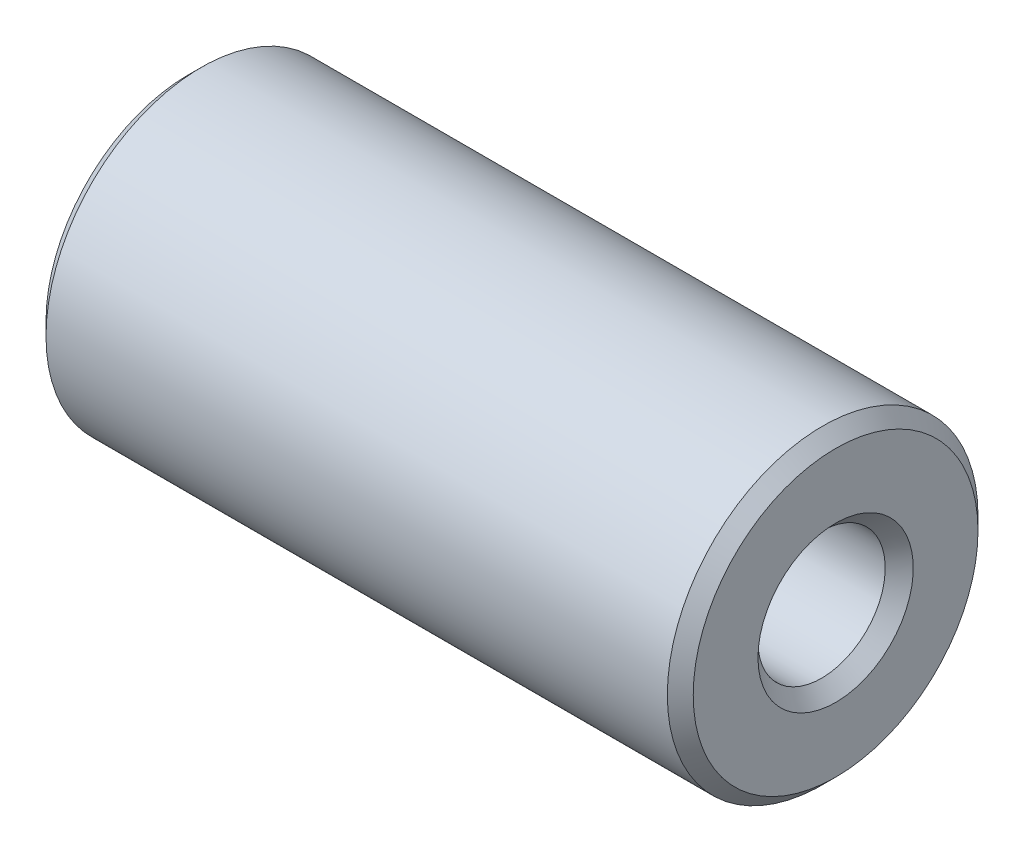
from build123d import *


with BuildPart() as part:
    # Sketch1 → Revolve1 (revolve)
    with BuildSketch(Plane(origin=(0, 0, 0), x_dir=(-1, 0, 0), z_dir=(0, 0, -1)), mode=Mode.PRIVATE) as revolve1_sk:
        Polygon((-25, 3), (-24.4585, 2.4585), (-0.5415, 2.4585), (0, 3), (0, 5.5), (-0.5, 6), (-24.5, 6), (-25, 5.5), align=None)
    revolve(revolve1_sk.sketch.rotate(Axis((25, 0, 0), (-1, 0, 0)), 270), axis=Axis((25, 0, 0), (-1, 0, 0)))


solid = part.part
